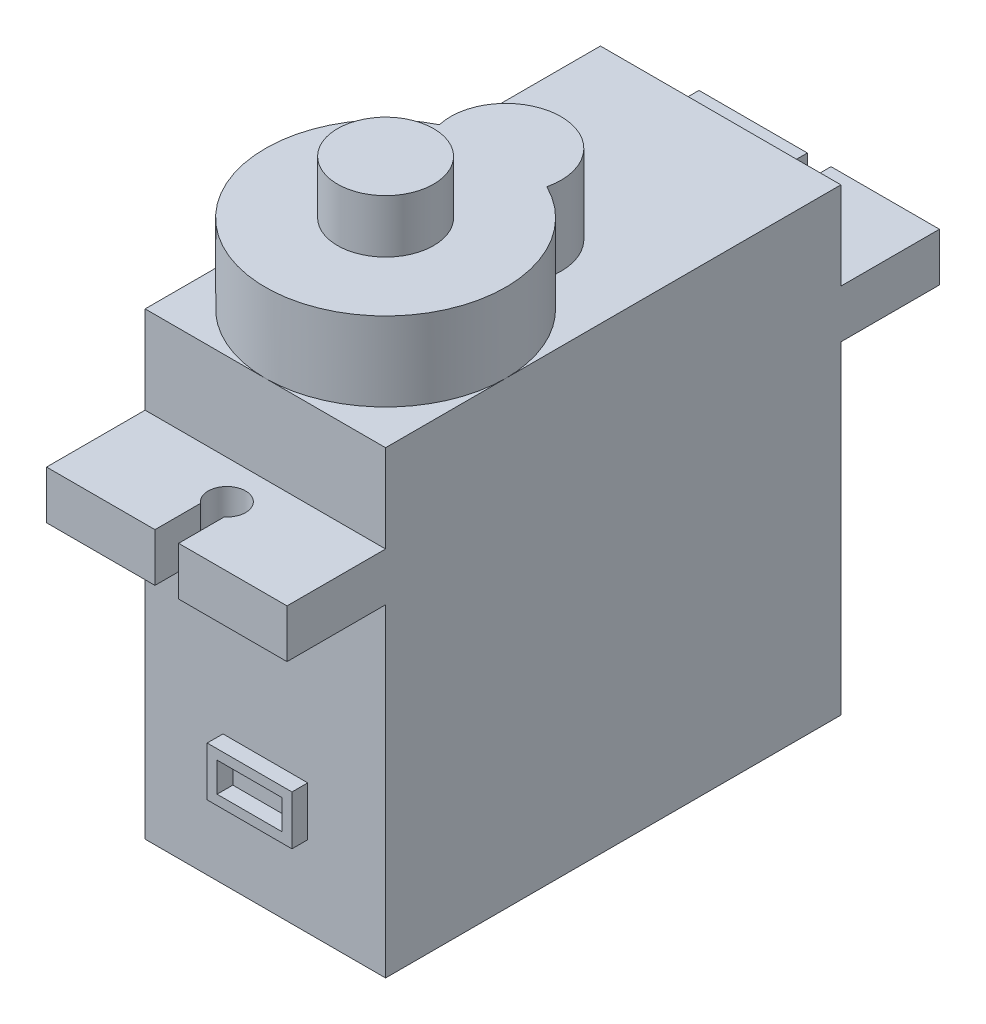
ISO-10303-21;
HEADER;
FILE_DESCRIPTION(('STEP AP214'),'2;1');
FILE_NAME('part.step','',(''),(''),'','','');
FILE_SCHEMA(('AUTOMOTIVE_DESIGN { 1 0 10303 214 1 1 1 1 }'));
ENDSEC;
DATA;
#1=APPLICATION_CONTEXT('core data for automotive mechanical design processes');
#2=APPLICATION_PROTOCOL_DEFINITION('international standard','automotive_design',2000,#1);
#3=PRODUCT_CONTEXT('',#1,'mechanical');
#4=PRODUCT('Part','Part','',(#3));
#5=PRODUCT_RELATED_PRODUCT_CATEGORY('part','',(#4));
#6=PRODUCT_DEFINITION_FORMATION('','',#4);
#7=PRODUCT_DEFINITION_CONTEXT('part definition',#1,'design');
#8=PRODUCT_DEFINITION('design','',#6,#7);
#9=PRODUCT_DEFINITION_SHAPE('','',#8);
#10=(LENGTH_UNIT() NAMED_UNIT(*) SI_UNIT(.MILLI.,.METRE.));
#11=(NAMED_UNIT(*) PLANE_ANGLE_UNIT() SI_UNIT($,.RADIAN.));
#12=(NAMED_UNIT(*) SI_UNIT($,.STERADIAN.) SOLID_ANGLE_UNIT());
#13=UNCERTAINTY_MEASURE_WITH_UNIT(LENGTH_MEASURE(1.E-05),#10,'distance_accuracy_value','');
#14=(GEOMETRIC_REPRESENTATION_CONTEXT(3) GLOBAL_UNCERTAINTY_ASSIGNED_CONTEXT((#13)) GLOBAL_UNIT_ASSIGNED_CONTEXT((#10,
#11,#12)) REPRESENTATION_CONTEXT('',''));
#15=CARTESIAN_POINT('',(0.,0.,0.));
#16=DIRECTION('',(0.,0.,1.));
#17=DIRECTION('',(1.,0.,0.));
#18=AXIS2_PLACEMENT_3D('',#15,#16,#17);
#19=CARTESIAN_POINT('',(12.2,18.85,-28.1));
#20=DIRECTION('',(0.,0.,1.));
#21=DIRECTION('',(1.,0.,0.));
#22=AXIS2_PLACEMENT_3D('',#19,#20,#21);
#23=PLANE('',#22);
#24=DIRECTION('',(-1.,0.,0.));
#25=VECTOR('',#24,1.);
#26=CARTESIAN_POINT('',(12.2,18.85,-28.1));
#27=LINE('',#26,#25);
#28=CARTESIAN_POINT('',(5.5,18.85,-28.1));
#29=VERTEX_POINT('',#28);
#30=CARTESIAN_POINT('',(0.,18.85,-28.1));
#31=VERTEX_POINT('',#30);
#32=EDGE_CURVE('E270',#29,#31,#27,.T.);
#33=ORIENTED_EDGE('',*,*,#32,.F.);
#34=DIRECTION('',(0.,1.,0.));
#35=VECTOR('',#34,1.);
#36=CARTESIAN_POINT('',(5.5,16.35,-28.1));
#37=LINE('',#36,#35);
#38=CARTESIAN_POINT('',(5.5,16.4,-28.1));
#39=VERTEX_POINT('',#38);
#40=EDGE_CURVE('E264',#39,#29,#37,.T.);
#41=ORIENTED_EDGE('',*,*,#40,.F.);
#42=DIRECTION('',(-1.,0.,0.));
#43=VECTOR('',#42,1.);
#44=CARTESIAN_POINT('',(12.2,16.4,-28.1));
#45=LINE('',#44,#43);
#46=CARTESIAN_POINT('',(0.,16.4,-28.1));
#47=VERTEX_POINT('',#46);
#48=EDGE_CURVE('E269',#39,#47,#45,.T.);
#49=ORIENTED_EDGE('',*,*,#48,.T.);
#50=DIRECTION('',(0.,1.,0.));
#51=VECTOR('',#50,1.);
#52=CARTESIAN_POINT('',(0.,18.85,-28.1));
#53=LINE('',#52,#51);
#54=EDGE_CURVE('E468',#47,#31,#53,.T.);
#55=ORIENTED_EDGE('',*,*,#54,.T.);
#56=EDGE_LOOP('',(#33,#41,#49,#55));
#57=FACE_BOUND('',#56,.T.);
#58=ADVANCED_FACE('F39',(#57),#23,.F.);
#59=CARTESIAN_POINT('',(12.2,18.85,5.));
#60=DIRECTION('',(0.,0.,-1.));
#61=DIRECTION('',(0.,1.,0.));
#62=AXIS2_PLACEMENT_3D('',#59,#60,#61);
#63=PLANE('',#62);
#64=DIRECTION('',(-1.,0.,0.));
#65=VECTOR('',#64,1.);
#66=CARTESIAN_POINT('',(12.2,18.85,5.));
#67=LINE('',#66,#65);
#68=CARTESIAN_POINT('',(12.2,18.85,5.));
#69=VERTEX_POINT('',#68);
#70=CARTESIAN_POINT('',(6.7,18.85,5.));
#71=VERTEX_POINT('',#70);
#72=EDGE_CURVE('E294',#69,#71,#67,.T.);
#73=ORIENTED_EDGE('',*,*,#72,.T.);
#74=DIRECTION('',(0.,1.,0.));
#75=VECTOR('',#74,1.);
#76=CARTESIAN_POINT('',(6.7,16.35,5.));
#77=LINE('',#76,#75);
#78=CARTESIAN_POINT('',(6.7,16.4,5.));
#79=VERTEX_POINT('',#78);
#80=EDGE_CURVE('E326',#79,#71,#77,.T.);
#81=ORIENTED_EDGE('',*,*,#80,.F.);
#82=DIRECTION('',(-1.,0.,0.));
#83=VECTOR('',#82,1.);
#84=CARTESIAN_POINT('',(12.2,16.4,4.99999999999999));
#85=LINE('',#84,#83);
#86=CARTESIAN_POINT('',(12.2,16.4,4.99999999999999));
#87=VERTEX_POINT('',#86);
#88=EDGE_CURVE('E290',#87,#79,#85,.T.);
#89=ORIENTED_EDGE('',*,*,#88,.F.);
#90=DIRECTION('',(0.,-1.,0.));
#91=VECTOR('',#90,1.);
#92=CARTESIAN_POINT('',(12.2,18.85,5.));
#93=LINE('',#92,#91);
#94=EDGE_CURVE('E428',#69,#87,#93,.T.);
#95=ORIENTED_EDGE('',*,*,#94,.F.);
#96=EDGE_LOOP('',(#73,#81,#89,#95));
#97=FACE_BOUND('',#96,.T.);
#98=ADVANCED_FACE('F561',(#97),#63,.F.);
#99=CARTESIAN_POINT('',(12.2,16.4,0.));
#100=DIRECTION('',(0.,0.,-1.));
#101=DIRECTION('',(0.,1.,0.));
#102=AXIS2_PLACEMENT_3D('',#99,#100,#101);
#103=PLANE('',#102);
#104=DIRECTION('',(0.,-1.,0.));
#105=VECTOR('',#104,1.);
#106=CARTESIAN_POINT('',(0.,16.4,0.));
#107=LINE('',#106,#105);
#108=CARTESIAN_POINT('',(0.,16.4,0.));
#109=VERTEX_POINT('',#108);
#110=CARTESIAN_POINT('',(0.,0.,0.));
#111=VERTEX_POINT('',#110);
#112=EDGE_CURVE('E459',#109,#111,#107,.T.);
#113=ORIENTED_EDGE('',*,*,#112,.T.);
#114=DIRECTION('',(-1.,0.,0.));
#115=VECTOR('',#114,1.);
#116=CARTESIAN_POINT('',(12.2,0.,0.));
#117=LINE('',#116,#115);
#118=CARTESIAN_POINT('',(12.2,0.,0.));
#119=VERTEX_POINT('',#118);
#120=EDGE_CURVE('E283',#119,#111,#117,.T.);
#121=ORIENTED_EDGE('',*,*,#120,.F.);
#122=DIRECTION('',(0.,-1.,0.));
#123=VECTOR('',#122,1.);
#124=CARTESIAN_POINT('',(12.2,16.4,0.));
#125=LINE('',#124,#123);
#126=CARTESIAN_POINT('',(12.2,16.4,0.));
#127=VERTEX_POINT('',#126);
#128=EDGE_CURVE('E432',#127,#119,#125,.T.);
#129=ORIENTED_EDGE('',*,*,#128,.F.);
#130=DIRECTION('',(-1.,0.,0.));
#131=VECTOR('',#130,1.);
#132=CARTESIAN_POINT('',(12.2,16.4,0.));
#133=LINE('',#132,#131);
#134=EDGE_CURVE('E286',#127,#109,#133,.T.);
#135=ORIENTED_EDGE('',*,*,#134,.T.);
#136=EDGE_LOOP('',(#113,#121,#129,#135));
#137=FACE_BOUND('',#136,.T.);
#138=DIRECTION('',(0.,-1.,0.));
#139=VECTOR('',#138,1.);
#140=CARTESIAN_POINT('',(3.95,4.1,0.));
#141=LINE('',#140,#139);
#142=CARTESIAN_POINT('',(3.95,6.6,0.));
#143=VERTEX_POINT('',#142);
#144=CARTESIAN_POINT('',(3.95,4.1,0.));
#145=VERTEX_POINT('',#144);
#146=EDGE_CURVE('E363',#143,#145,#141,.T.);
#147=ORIENTED_EDGE('',*,*,#146,.F.);
#148=DIRECTION('',(-1.,0.,0.));
#149=VECTOR('',#148,1.);
#150=CARTESIAN_POINT('',(3.95,6.6,0.));
#151=LINE('',#150,#149);
#152=CARTESIAN_POINT('',(8.25,6.6,0.));
#153=VERTEX_POINT('',#152);
#154=EDGE_CURVE('E368',#153,#143,#151,.T.);
#155=ORIENTED_EDGE('',*,*,#154,.F.);
#156=DIRECTION('',(0.,1.,0.));
#157=VECTOR('',#156,1.);
#158=CARTESIAN_POINT('',(8.25,4.1,0.));
#159=LINE('',#158,#157);
#160=CARTESIAN_POINT('',(8.25,4.1,0.));
#161=VERTEX_POINT('',#160);
#162=EDGE_CURVE('E380',#161,#153,#159,.T.);
#163=ORIENTED_EDGE('',*,*,#162,.F.);
#164=DIRECTION('',(1.,0.,0.));
#165=VECTOR('',#164,1.);
#166=CARTESIAN_POINT('',(3.95,4.1,0.));
#167=LINE('',#166,#165);
#168=EDGE_CURVE('E377',#145,#161,#167,.T.);
#169=ORIENTED_EDGE('',*,*,#168,.F.);
#170=EDGE_LOOP('',(#147,#155,#163,#169));
#171=FACE_BOUND('',#170,.T.);
#172=ADVANCED_FACE('F553',(#137,#171),#103,.F.);
#173=CARTESIAN_POINT('',(6.1,27.3,-9.14999999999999));
#174=DIRECTION('',(0.,1.,0.));
#175=DIRECTION('',(0.,0.,1.));
#176=AXIS2_PLACEMENT_3D('',#173,#174,#175);
#177=PLANE('',#176);
#178=CARTESIAN_POINT('',(6.1,27.3,-12.2));
#179=DIRECTION('',(0.,1.,0.));
#180=DIRECTION('',(0.,0.,1.));
#181=AXIS2_PLACEMENT_3D('',#178,#179,#180);
#182=CIRCLE('',#181,2.8);
#183=CARTESIAN_POINT('',(8.82525883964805,27.3,-11.5573770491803));
#184=VERTEX_POINT('',#183);
#185=CARTESIAN_POINT('',(3.37474116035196,27.3,-11.5573770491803));
#186=VERTEX_POINT('',#185);
#187=EDGE_CURVE('E403',#184,#186,#182,.T.);
#188=ORIENTED_EDGE('',*,*,#187,.T.);
#189=CARTESIAN_POINT('',(6.1,27.3,-6.09999999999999));
#190=DIRECTION('',(0.,1.,0.));
#191=DIRECTION('',(0.,0.,1.));
#192=AXIS2_PLACEMENT_3D('',#189,#190,#191);
#193=CIRCLE('',#192,6.09999999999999);
#194=EDGE_CURVE('E406',#186,#184,#193,.T.);
#195=ORIENTED_EDGE('',*,*,#194,.T.);
#196=EDGE_LOOP('',(#188,#195));
#197=FACE_BOUND('',#196,.T.);
#198=CARTESIAN_POINT('',(6.1,27.3,-6.09999999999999));
#199=DIRECTION('',(0.,1.,0.));
#200=DIRECTION('',(0.,0.,1.));
#201=AXIS2_PLACEMENT_3D('',#198,#199,#200);
#202=CIRCLE('',#201,2.44);
#203=CARTESIAN_POINT('',(6.1,27.3,-8.53999999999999));
#204=VERTEX_POINT('',#203);
#205=EDGE_CURVE('E396',#204,#204,#202,.T.);
#206=ORIENTED_EDGE('',*,*,#205,.F.);
#207=EDGE_LOOP('',(#206));
#208=FACE_BOUND('',#207,.T.);
#209=ADVANCED_FACE('F568',(#197,#208),#177,.T.);
#210=CARTESIAN_POINT('',(12.2,23.3,0.));
#211=DIRECTION('',(0.,-1.,0.));
#212=DIRECTION('',(0.,0.,-1.));
#213=AXIS2_PLACEMENT_3D('',#210,#211,#212);
#214=PLANE('',#213);
#215=CARTESIAN_POINT('',(6.1,23.3,-12.2));
#216=DIRECTION('',(0.,1.,0.));
#217=DIRECTION('',(0.,0.,1.));
#218=AXIS2_PLACEMENT_3D('',#215,#216,#217);
#219=CIRCLE('',#218,2.8);
#220=CARTESIAN_POINT('',(8.82525883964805,23.3,-11.5573770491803));
#221=VERTEX_POINT('',#220);
#222=CARTESIAN_POINT('',(3.37474116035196,23.3,-11.5573770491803));
#223=VERTEX_POINT('',#222);
#224=EDGE_CURVE('E400',#221,#223,#219,.T.);
#225=ORIENTED_EDGE('',*,*,#224,.F.);
#226=CARTESIAN_POINT('',(6.1,23.3,-6.09999999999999));
#227=DIRECTION('',(0.,1.,0.));
#228=DIRECTION('',(0.,0.,1.));
#229=AXIS2_PLACEMENT_3D('',#226,#227,#228);
#230=CIRCLE('',#229,6.09999999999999);
#231=CARTESIAN_POINT('',(12.2,23.3,-6.09999999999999));
#232=VERTEX_POINT('',#231);
#233=EDGE_CURVE('E304',#232,#221,#230,.T.);
#234=ORIENTED_EDGE('',*,*,#233,.F.);
#235=DIRECTION('',(0.,0.,1.));
#236=VECTOR('',#235,1.);
#237=CARTESIAN_POINT('',(12.2,23.3,0.));
#238=LINE('',#237,#236);
#239=CARTESIAN_POINT('',(12.2,23.3,-23.1));
#240=VERTEX_POINT('',#239);
#241=EDGE_CURVE('E420',#240,#232,#238,.T.);
#242=ORIENTED_EDGE('',*,*,#241,.F.);
#243=DIRECTION('',(-1.,0.,0.));
#244=VECTOR('',#243,1.);
#245=CARTESIAN_POINT('',(12.2,23.3,-23.1));
#246=LINE('',#245,#244);
#247=CARTESIAN_POINT('',(0.,23.3,-23.1));
#248=VERTEX_POINT('',#247);
#249=EDGE_CURVE('E445',#240,#248,#246,.T.);
#250=ORIENTED_EDGE('',*,*,#249,.T.);
#251=DIRECTION('',(0.,0.,1.));
#252=VECTOR('',#251,1.);
#253=CARTESIAN_POINT('',(0.,23.3,0.));
#254=LINE('',#253,#252);
#255=CARTESIAN_POINT('',(0.,23.3,-6.09999999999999));
#256=VERTEX_POINT('',#255);
#257=EDGE_CURVE('E446',#248,#256,#254,.T.);
#258=ORIENTED_EDGE('',*,*,#257,.T.);
#259=EDGE_CURVE('E407',#223,#256,#230,.T.);
#260=ORIENTED_EDGE('',*,*,#259,.F.);
#261=EDGE_LOOP('',(#225,#234,#242,#250,#258,#260));
#262=FACE_BOUND('',#261,.T.);
#263=ADVANCED_FACE('F41',(#262),#214,.F.);
#264=CARTESIAN_POINT('',(6.1,23.3,0.));
#265=VERTEX_POINT('',#264);
#266=EDGE_CURVE('E306',#256,#265,#230,.T.);
#267=ORIENTED_EDGE('',*,*,#266,.F.);
#268=CARTESIAN_POINT('',(0.,23.3,0.));
#269=VERTEX_POINT('',#268);
#270=EDGE_CURVE('E419',#256,#269,#254,.T.);
#271=ORIENTED_EDGE('',*,*,#270,.T.);
#272=DIRECTION('',(-1.,0.,0.));
#273=VECTOR('',#272,1.);
#274=CARTESIAN_POINT('',(12.2,23.3,0.));
#275=LINE('',#274,#273);
#276=EDGE_CURVE('E300',#265,#269,#275,.T.);
#277=ORIENTED_EDGE('',*,*,#276,.F.);
#278=EDGE_LOOP('',(#267,#271,#277));
#279=FACE_BOUND('',#278,.T.);
#280=ADVANCED_FACE('F508',(#279),#214,.F.);
#281=EDGE_CURVE('E502',#265,#232,#230,.T.);
#282=ORIENTED_EDGE('',*,*,#281,.F.);
#283=CARTESIAN_POINT('',(12.2,23.3,0.));
#284=VERTEX_POINT('',#283);
#285=EDGE_CURVE('E301',#284,#265,#275,.T.);
#286=ORIENTED_EDGE('',*,*,#285,.F.);
#287=EDGE_CURVE('E424',#232,#284,#238,.T.);
#288=ORIENTED_EDGE('',*,*,#287,.F.);
#289=EDGE_LOOP('',(#282,#286,#288));
#290=FACE_BOUND('',#289,.T.);
#291=ADVANCED_FACE('F506',(#290),#214,.F.);
#292=CARTESIAN_POINT('',(12.2,23.3,0.));
#293=DIRECTION('',(0.,0.,-1.));
#294=DIRECTION('',(0.,1.,0.));
#295=AXIS2_PLACEMENT_3D('',#292,#293,#294);
#296=PLANE('',#295);
#297=DIRECTION('',(0.,-1.,0.));
#298=VECTOR('',#297,1.);
#299=CARTESIAN_POINT('',(0.,23.3,0.));
#300=LINE('',#299,#298);
#301=CARTESIAN_POINT('',(0.,18.85,0.));
#302=VERTEX_POINT('',#301);
#303=EDGE_CURVE('E449',#269,#302,#300,.T.);
#304=ORIENTED_EDGE('',*,*,#303,.T.);
#305=DIRECTION('',(-1.,0.,0.));
#306=VECTOR('',#305,1.);
#307=CARTESIAN_POINT('',(12.2,18.85,0.));
#308=LINE('',#307,#306);
#309=CARTESIAN_POINT('',(12.2,18.85,0.));
#310=VERTEX_POINT('',#309);
#311=EDGE_CURVE('E297',#310,#302,#308,.T.);
#312=ORIENTED_EDGE('',*,*,#311,.F.);
#313=DIRECTION('',(0.,-1.,0.));
#314=VECTOR('',#313,1.);
#315=CARTESIAN_POINT('',(12.2,23.3,0.));
#316=LINE('',#315,#314);
#317=EDGE_CURVE('E423',#284,#310,#316,.T.);
#318=ORIENTED_EDGE('',*,*,#317,.F.);
#319=ORIENTED_EDGE('',*,*,#285,.T.);
#320=ORIENTED_EDGE('',*,*,#276,.T.);
#321=EDGE_LOOP('',(#304,#312,#318,#319,#320));
#322=FACE_BOUND('',#321,.T.);
#323=ADVANCED_FACE('F511',(#322),#296,.F.);
#324=CARTESIAN_POINT('',(12.2,18.85,0.));
#325=DIRECTION('',(0.,-1.,0.));
#326=DIRECTION('',(0.,0.,-1.));
#327=AXIS2_PLACEMENT_3D('',#324,#325,#326);
#328=PLANE('',#327);
#329=CARTESIAN_POINT('',(6.1,18.85,1.95));
#330=DIRECTION('',(0.,1.,0.));
#331=DIRECTION('',(0.,0.,1.));
#332=AXIS2_PLACEMENT_3D('',#329,#330,#331);
#333=CIRCLE('',#332,0.95);
#334=CARTESIAN_POINT('',(6.7,18.85,2.68654599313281));
#335=VERTEX_POINT('',#334);
#336=CARTESIAN_POINT('',(5.5,18.85,2.68654599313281));
#337=VERTEX_POINT('',#336);
#338=EDGE_CURVE('E535',#335,#337,#333,.T.);
#339=ORIENTED_EDGE('',*,*,#338,.F.);
#340=DIRECTION('',(0.,0.,-1.));
#341=VECTOR('',#340,1.);
#342=CARTESIAN_POINT('',(6.7,18.85,5.));
#343=LINE('',#342,#341);
#344=EDGE_CURVE('E323',#71,#335,#343,.T.);
#345=ORIENTED_EDGE('',*,*,#344,.F.);
#346=ORIENTED_EDGE('',*,*,#72,.F.);
#347=DIRECTION('',(0.,0.,1.));
#348=VECTOR('',#347,1.);
#349=CARTESIAN_POINT('',(12.2,18.85,0.));
#350=LINE('',#349,#348);
#351=EDGE_CURVE('E426',#310,#69,#350,.T.);
#352=ORIENTED_EDGE('',*,*,#351,.F.);
#353=ORIENTED_EDGE('',*,*,#311,.T.);
#354=DIRECTION('',(0.,0.,1.));
#355=VECTOR('',#354,1.);
#356=CARTESIAN_POINT('',(0.,18.85,0.));
#357=LINE('',#356,#355);
#358=CARTESIAN_POINT('',(0.,18.85,5.));
#359=VERTEX_POINT('',#358);
#360=EDGE_CURVE('E451',#302,#359,#357,.T.);
#361=ORIENTED_EDGE('',*,*,#360,.T.);
#362=CARTESIAN_POINT('',(5.5,18.85,5.));
#363=VERTEX_POINT('',#362);
#364=EDGE_CURVE('E293',#363,#359,#67,.T.);
#365=ORIENTED_EDGE('',*,*,#364,.F.);
#366=DIRECTION('',(0.,0.,1.));
#367=VECTOR('',#366,1.);
#368=CARTESIAN_POINT('',(5.5,18.85,2.68654599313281));
#369=LINE('',#368,#367);
#370=EDGE_CURVE('E536',#337,#363,#369,.T.);
#371=ORIENTED_EDGE('',*,*,#370,.F.);
#372=EDGE_LOOP('',(#339,#345,#346,#352,#353,#361,#365,#371));
#373=FACE_BOUND('',#372,.T.);
#374=ADVANCED_FACE('F543',(#373),#328,.F.);
#375=CARTESIAN_POINT('',(5.5,16.4,4.99999999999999));
#376=VERTEX_POINT('',#375);
#377=CARTESIAN_POINT('',(0.,16.4,4.99999999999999));
#378=VERTEX_POINT('',#377);
#379=EDGE_CURVE('E289',#376,#378,#85,.T.);
#380=ORIENTED_EDGE('',*,*,#379,.F.);
#381=DIRECTION('',(0.,1.,0.));
#382=VECTOR('',#381,1.);
#383=CARTESIAN_POINT('',(5.5,16.35,5.));
#384=LINE('',#383,#382);
#385=EDGE_CURVE('E62',#376,#363,#384,.T.);
#386=ORIENTED_EDGE('',*,*,#385,.T.);
#387=ORIENTED_EDGE('',*,*,#364,.T.);
#388=DIRECTION('',(0.,-1.,0.));
#389=VECTOR('',#388,1.);
#390=CARTESIAN_POINT('',(0.,18.85,5.));
#391=LINE('',#390,#389);
#392=EDGE_CURVE('E454',#359,#378,#391,.T.);
#393=ORIENTED_EDGE('',*,*,#392,.T.);
#394=EDGE_LOOP('',(#380,#386,#387,#393));
#395=FACE_BOUND('',#394,.T.);
#396=ADVANCED_FACE('F542',(#395),#63,.F.);
#397=CARTESIAN_POINT('',(12.2,16.4,4.99999999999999));
#398=DIRECTION('',(0.,1.,0.));
#399=DIRECTION('',(0.,0.,1.));
#400=AXIS2_PLACEMENT_3D('',#397,#398,#399);
#401=PLANE('',#400);
#402=ORIENTED_EDGE('',*,*,#88,.T.);
#403=DIRECTION('',(0.,0.,-1.));
#404=VECTOR('',#403,1.);
#405=CARTESIAN_POINT('',(6.7,16.4,4.99999999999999));
#406=LINE('',#405,#404);
#407=CARTESIAN_POINT('',(6.7,16.4,2.68654599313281));
#408=VERTEX_POINT('',#407);
#409=EDGE_CURVE('E11',#79,#408,#406,.T.);
#410=ORIENTED_EDGE('',*,*,#409,.T.);
#411=CARTESIAN_POINT('',(6.1,16.4,1.95));
#412=DIRECTION('',(0.,1.,0.));
#413=DIRECTION('',(0.,0.,1.));
#414=AXIS2_PLACEMENT_3D('',#411,#412,#413);
#415=CIRCLE('',#414,0.95);
#416=CARTESIAN_POINT('',(5.5,16.4,2.68654599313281));
#417=VERTEX_POINT('',#416);
#418=EDGE_CURVE('E47',#408,#417,#415,.T.);
#419=ORIENTED_EDGE('',*,*,#418,.T.);
#420=DIRECTION('',(0.,0.,1.));
#421=VECTOR('',#420,1.);
#422=CARTESIAN_POINT('',(5.5,16.4,4.99999999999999));
#423=LINE('',#422,#421);
#424=EDGE_CURVE('E305',#417,#376,#423,.T.);
#425=ORIENTED_EDGE('',*,*,#424,.T.);
#426=ORIENTED_EDGE('',*,*,#379,.T.);
#427=DIRECTION('',(0.,0.,-1.));
#428=VECTOR('',#427,1.);
#429=CARTESIAN_POINT('',(0.,16.4,4.99999999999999));
#430=LINE('',#429,#428);
#431=EDGE_CURVE('E457',#378,#109,#430,.T.);
#432=ORIENTED_EDGE('',*,*,#431,.T.);
#433=ORIENTED_EDGE('',*,*,#134,.F.);
#434=DIRECTION('',(0.,0.,-1.));
#435=VECTOR('',#434,1.);
#436=CARTESIAN_POINT('',(12.2,16.4,4.99999999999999));
#437=LINE('',#436,#435);
#438=EDGE_CURVE('E430',#87,#127,#437,.T.);
#439=ORIENTED_EDGE('',*,*,#438,.F.);
#440=EDGE_LOOP('',(#402,#410,#419,#425,#426,#432,#433,#439));
#441=FACE_BOUND('',#440,.T.);
#442=ADVANCED_FACE('F309',(#441),#401,.F.);
#443=CARTESIAN_POINT('',(12.2,0.,0.));
#444=DIRECTION('',(0.,1.,0.));
#445=DIRECTION('',(0.,0.,1.));
#446=AXIS2_PLACEMENT_3D('',#443,#444,#445);
#447=PLANE('',#446);
#448=DIRECTION('',(0.,0.,-1.));
#449=VECTOR('',#448,1.);
#450=CARTESIAN_POINT('',(0.,0.,0.));
#451=LINE('',#450,#449);
#452=CARTESIAN_POINT('',(0.,0.,-23.1));
#453=VERTEX_POINT('',#452);
#454=EDGE_CURVE('E461',#111,#453,#451,.T.);
#455=ORIENTED_EDGE('',*,*,#454,.T.);
#456=DIRECTION('',(-1.,0.,0.));
#457=VECTOR('',#456,1.);
#458=CARTESIAN_POINT('',(12.2,0.,-23.1));
#459=LINE('',#458,#457);
#460=CARTESIAN_POINT('',(12.2,0.,-23.1));
#461=VERTEX_POINT('',#460);
#462=EDGE_CURVE('E280',#461,#453,#459,.T.);
#463=ORIENTED_EDGE('',*,*,#462,.F.);
#464=DIRECTION('',(0.,0.,-1.));
#465=VECTOR('',#464,1.);
#466=CARTESIAN_POINT('',(12.2,0.,0.));
#467=LINE('',#466,#465);
#468=EDGE_CURVE('E434',#119,#461,#467,.T.);
#469=ORIENTED_EDGE('',*,*,#468,.F.);
#470=ORIENTED_EDGE('',*,*,#120,.T.);
#471=EDGE_LOOP('',(#455,#463,#469,#470));
#472=FACE_BOUND('',#471,.T.);
#473=ADVANCED_FACE('F580',(#472),#447,.F.);
#474=CARTESIAN_POINT('',(12.2,16.4,-23.1));
#475=DIRECTION('',(0.,0.,1.));
#476=DIRECTION('',(1.,0.,0.));
#477=AXIS2_PLACEMENT_3D('',#474,#475,#476);
#478=PLANE('',#477);
#479=DIRECTION('',(0.,1.,0.));
#480=VECTOR('',#479,1.);
#481=CARTESIAN_POINT('',(0.,16.4,-23.1));
#482=LINE('',#481,#480);
#483=CARTESIAN_POINT('',(0.,16.4,-23.1));
#484=VERTEX_POINT('',#483);
#485=EDGE_CURVE('E463',#453,#484,#482,.T.);
#486=ORIENTED_EDGE('',*,*,#485,.T.);
#487=DIRECTION('',(-1.,0.,0.));
#488=VECTOR('',#487,1.);
#489=CARTESIAN_POINT('',(12.2,16.4,-23.1));
#490=LINE('',#489,#488);
#491=CARTESIAN_POINT('',(12.2,16.4,-23.1));
#492=VERTEX_POINT('',#491);
#493=EDGE_CURVE('E277',#492,#484,#490,.T.);
#494=ORIENTED_EDGE('',*,*,#493,.F.);
#495=DIRECTION('',(0.,1.,0.));
#496=VECTOR('',#495,1.);
#497=CARTESIAN_POINT('',(12.2,16.4,-23.1));
#498=LINE('',#497,#496);
#499=EDGE_CURVE('E436',#461,#492,#498,.T.);
#500=ORIENTED_EDGE('',*,*,#499,.F.);
#501=ORIENTED_EDGE('',*,*,#462,.T.);
#502=EDGE_LOOP('',(#486,#494,#500,#501));
#503=FACE_BOUND('',#502,.T.);
#504=ADVANCED_FACE('F618',(#503),#478,.F.);
#505=CARTESIAN_POINT('',(12.2,16.4,-28.1));
#506=DIRECTION('',(0.,1.,0.));
#507=DIRECTION('',(0.,0.,1.));
#508=AXIS2_PLACEMENT_3D('',#505,#506,#507);
#509=PLANE('',#508);
#510=ORIENTED_EDGE('',*,*,#48,.F.);
#511=DIRECTION('',(0.,0.,1.));
#512=VECTOR('',#511,1.);
#513=CARTESIAN_POINT('',(5.5,16.4,-28.1));
#514=LINE('',#513,#512);
#515=CARTESIAN_POINT('',(5.5,16.4,-25.7865459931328));
#516=VERTEX_POINT('',#515);
#517=EDGE_CURVE('E527',#39,#516,#514,.T.);
#518=ORIENTED_EDGE('',*,*,#517,.T.);
#519=CARTESIAN_POINT('',(6.1,16.4,-25.05));
#520=DIRECTION('',(0.,1.,0.));
#521=DIRECTION('',(0.,0.,1.));
#522=AXIS2_PLACEMENT_3D('',#519,#520,#521);
#523=CIRCLE('',#522,0.949999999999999);
#524=CARTESIAN_POINT('',(6.7,16.4,-25.7865459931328));
#525=VERTEX_POINT('',#524);
#526=EDGE_CURVE('E526',#516,#525,#523,.T.);
#527=ORIENTED_EDGE('',*,*,#526,.T.);
#528=DIRECTION('',(0.,0.,-1.));
#529=VECTOR('',#528,1.);
#530=CARTESIAN_POINT('',(6.69999999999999,16.4,-28.1));
#531=LINE('',#530,#529);
#532=CARTESIAN_POINT('',(6.69999999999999,16.4,-28.1));
#533=VERTEX_POINT('',#532);
#534=EDGE_CURVE('E524',#525,#533,#531,.T.);
#535=ORIENTED_EDGE('',*,*,#534,.T.);
#536=CARTESIAN_POINT('',(12.2,16.4,-28.1));
#537=VERTEX_POINT('',#536);
#538=EDGE_CURVE('E263',#537,#533,#45,.T.);
#539=ORIENTED_EDGE('',*,*,#538,.F.);
#540=DIRECTION('',(0.,0.,-1.));
#541=VECTOR('',#540,1.);
#542=CARTESIAN_POINT('',(12.2,16.4,-28.1));
#543=LINE('',#542,#541);
#544=EDGE_CURVE('E438',#492,#537,#543,.T.);
#545=ORIENTED_EDGE('',*,*,#544,.F.);
#546=ORIENTED_EDGE('',*,*,#493,.T.);
#547=DIRECTION('',(0.,0.,-1.));
#548=VECTOR('',#547,1.);
#549=CARTESIAN_POINT('',(0.,16.4,-28.1));
#550=LINE('',#549,#548);
#551=EDGE_CURVE('E465',#484,#47,#550,.T.);
#552=ORIENTED_EDGE('',*,*,#551,.T.);
#553=EDGE_LOOP('',(#510,#518,#527,#535,#539,#545,#546,#552));
#554=FACE_BOUND('',#553,.T.);
#555=ADVANCED_FACE('F522',(#554),#509,.F.);
#556=ORIENTED_EDGE('',*,*,#538,.T.);
#557=DIRECTION('',(0.,1.,0.));
#558=VECTOR('',#557,1.);
#559=CARTESIAN_POINT('',(6.69999999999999,16.35,-28.1));
#560=LINE('',#559,#558);
#561=CARTESIAN_POINT('',(6.69999999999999,18.85,-28.1));
#562=VERTEX_POINT('',#561);
#563=EDGE_CURVE('E248',#533,#562,#560,.T.);
#564=ORIENTED_EDGE('',*,*,#563,.T.);
#565=CARTESIAN_POINT('',(12.2,18.85,-28.1));
#566=VERTEX_POINT('',#565);
#567=EDGE_CURVE('E260',#566,#562,#27,.T.);
#568=ORIENTED_EDGE('',*,*,#567,.F.);
#569=DIRECTION('',(0.,1.,0.));
#570=VECTOR('',#569,1.);
#571=CARTESIAN_POINT('',(12.2,18.85,-28.1));
#572=LINE('',#571,#570);
#573=EDGE_CURVE('E440',#537,#566,#572,.T.);
#574=ORIENTED_EDGE('',*,*,#573,.F.);
#575=EDGE_LOOP('',(#556,#564,#568,#574));
#576=FACE_BOUND('',#575,.T.);
#577=ADVANCED_FACE('F258',(#576),#23,.F.);
#578=CARTESIAN_POINT('',(12.2,18.85,-23.1));
#579=DIRECTION('',(0.,-1.,0.));
#580=DIRECTION('',(0.,0.,-1.));
#581=AXIS2_PLACEMENT_3D('',#578,#579,#580);
#582=PLANE('',#581);
#583=CARTESIAN_POINT('',(6.1,18.85,-25.05));
#584=DIRECTION('',(0.,1.,0.));
#585=DIRECTION('',(0.,0.,-1.));
#586=AXIS2_PLACEMENT_3D('',#583,#584,#585);
#587=CIRCLE('',#586,0.949999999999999);
#588=CARTESIAN_POINT('',(5.5,18.85,-25.7865459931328));
#589=VERTEX_POINT('',#588);
#590=CARTESIAN_POINT('',(6.7,18.85,-25.7865459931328));
#591=VERTEX_POINT('',#590);
#592=EDGE_CURVE('E54',#589,#591,#587,.T.);
#593=ORIENTED_EDGE('',*,*,#592,.F.);
#594=DIRECTION('',(0.,0.,1.));
#595=VECTOR('',#594,1.);
#596=CARTESIAN_POINT('',(5.5,18.85,-25.7865459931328));
#597=LINE('',#596,#595);
#598=EDGE_CURVE('E253',#29,#589,#597,.T.);
#599=ORIENTED_EDGE('',*,*,#598,.F.);
#600=ORIENTED_EDGE('',*,*,#32,.T.);
#601=DIRECTION('',(0.,0.,1.));
#602=VECTOR('',#601,1.);
#603=CARTESIAN_POINT('',(0.,18.85,-23.1));
#604=LINE('',#603,#602);
#605=CARTESIAN_POINT('',(0.,18.85,-23.1));
#606=VERTEX_POINT('',#605);
#607=EDGE_CURVE('E471',#31,#606,#604,.T.);
#608=ORIENTED_EDGE('',*,*,#607,.T.);
#609=DIRECTION('',(-1.,0.,0.));
#610=VECTOR('',#609,1.);
#611=CARTESIAN_POINT('',(12.2,18.85,-23.1));
#612=LINE('',#611,#610);
#613=CARTESIAN_POINT('',(12.2,18.85,-23.1));
#614=VERTEX_POINT('',#613);
#615=EDGE_CURVE('E273',#614,#606,#612,.T.);
#616=ORIENTED_EDGE('',*,*,#615,.F.);
#617=DIRECTION('',(0.,0.,1.));
#618=VECTOR('',#617,1.);
#619=CARTESIAN_POINT('',(12.2,18.85,-23.1));
#620=LINE('',#619,#618);
#621=EDGE_CURVE('E268',#566,#614,#620,.T.);
#622=ORIENTED_EDGE('',*,*,#621,.F.);
#623=ORIENTED_EDGE('',*,*,#567,.T.);
#624=DIRECTION('',(0.,0.,-1.));
#625=VECTOR('',#624,1.);
#626=CARTESIAN_POINT('',(6.69999999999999,18.85,-28.1));
#627=LINE('',#626,#625);
#628=EDGE_CURVE('E245',#591,#562,#627,.T.);
#629=ORIENTED_EDGE('',*,*,#628,.F.);
#630=EDGE_LOOP('',(#593,#599,#600,#608,#616,#622,#623,#629));
#631=FACE_BOUND('',#630,.T.);
#632=ADVANCED_FACE('F266',(#631),#582,.F.);
#633=CARTESIAN_POINT('',(12.2,23.3,-23.1));
#634=DIRECTION('',(0.,0.,1.));
#635=DIRECTION('',(1.,0.,0.));
#636=AXIS2_PLACEMENT_3D('',#633,#634,#635);
#637=PLANE('',#636);
#638=DIRECTION('',(0.,1.,0.));
#639=VECTOR('',#638,1.);
#640=CARTESIAN_POINT('',(0.,23.3,-23.1));
#641=LINE('',#640,#639);
#642=EDGE_CURVE('E473',#606,#248,#641,.T.);
#643=ORIENTED_EDGE('',*,*,#642,.T.);
#644=ORIENTED_EDGE('',*,*,#249,.F.);
#645=DIRECTION('',(0.,1.,0.));
#646=VECTOR('',#645,1.);
#647=CARTESIAN_POINT('',(12.2,23.3,-23.1));
#648=LINE('',#647,#646);
#649=EDGE_CURVE('E443',#614,#240,#648,.T.);
#650=ORIENTED_EDGE('',*,*,#649,.F.);
#651=ORIENTED_EDGE('',*,*,#615,.T.);
#652=EDGE_LOOP('',(#643,#644,#650,#651));
#653=FACE_BOUND('',#652,.T.);
#654=ADVANCED_FACE('F483',(#653),#637,.F.);
#655=CARTESIAN_POINT('',(12.2,0.,0.));
#656=DIRECTION('',(-1.,0.,0.));
#657=DIRECTION('',(0.,0.,1.));
#658=AXIS2_PLACEMENT_3D('',#655,#656,#657);
#659=PLANE('',#658);
#660=ORIENTED_EDGE('',*,*,#241,.T.);
#661=ORIENTED_EDGE('',*,*,#287,.T.);
#662=ORIENTED_EDGE('',*,*,#317,.T.);
#663=ORIENTED_EDGE('',*,*,#351,.T.);
#664=ORIENTED_EDGE('',*,*,#94,.T.);
#665=ORIENTED_EDGE('',*,*,#438,.T.);
#666=ORIENTED_EDGE('',*,*,#128,.T.);
#667=ORIENTED_EDGE('',*,*,#468,.T.);
#668=ORIENTED_EDGE('',*,*,#499,.T.);
#669=ORIENTED_EDGE('',*,*,#544,.T.);
#670=ORIENTED_EDGE('',*,*,#573,.T.);
#671=ORIENTED_EDGE('',*,*,#621,.T.);
#672=ORIENTED_EDGE('',*,*,#649,.T.);
#673=EDGE_LOOP('',(#660,#661,#662,#663,#664,#665,#666,#667,#668,#669,#670,#671,#672));
#674=FACE_BOUND('',#673,.T.);
#675=ADVANCED_FACE('F515',(#674),#659,.F.);
#676=CARTESIAN_POINT('',(0.,0.,0.));
#677=DIRECTION('',(-1.,0.,0.));
#678=DIRECTION('',(0.,0.,1.));
#679=AXIS2_PLACEMENT_3D('',#676,#677,#678);
#680=PLANE('',#679);
#681=ORIENTED_EDGE('',*,*,#257,.F.);
#682=ORIENTED_EDGE('',*,*,#642,.F.);
#683=ORIENTED_EDGE('',*,*,#607,.F.);
#684=ORIENTED_EDGE('',*,*,#54,.F.);
#685=ORIENTED_EDGE('',*,*,#551,.F.);
#686=ORIENTED_EDGE('',*,*,#485,.F.);
#687=ORIENTED_EDGE('',*,*,#454,.F.);
#688=ORIENTED_EDGE('',*,*,#112,.F.);
#689=ORIENTED_EDGE('',*,*,#431,.F.);
#690=ORIENTED_EDGE('',*,*,#392,.F.);
#691=ORIENTED_EDGE('',*,*,#360,.F.);
#692=ORIENTED_EDGE('',*,*,#303,.F.);
#693=ORIENTED_EDGE('',*,*,#270,.F.);
#694=EDGE_LOOP('',(#681,#682,#683,#684,#685,#686,#687,#688,#689,#690,#691,#692,#693));
#695=FACE_BOUND('',#694,.T.);
#696=ADVANCED_FACE('F486',(#695),#680,.T.);
#697=CARTESIAN_POINT('',(6.1,27.3,-12.2));
#698=DIRECTION('',(0.,-1.,0.));
#699=DIRECTION('',(0.,0.,-1.));
#700=AXIS2_PLACEMENT_3D('',#697,#698,#699);
#701=CYLINDRICAL_SURFACE('',#700,2.8);
#702=ORIENTED_EDGE('',*,*,#224,.T.);
#703=DIRECTION('',(0.,-1.,0.));
#704=VECTOR('',#703,1.);
#705=CARTESIAN_POINT('',(3.37474116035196,27.3,-11.5573770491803));
#706=LINE('',#705,#704);
#707=EDGE_CURVE('E416',#186,#223,#706,.T.);
#708=ORIENTED_EDGE('',*,*,#707,.F.);
#709=ORIENTED_EDGE('',*,*,#187,.F.);
#710=DIRECTION('',(0.,-1.,0.));
#711=VECTOR('',#710,1.);
#712=CARTESIAN_POINT('',(8.82525883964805,27.3,-11.5573770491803));
#713=LINE('',#712,#711);
#714=EDGE_CURVE('E409',#184,#221,#713,.T.);
#715=ORIENTED_EDGE('',*,*,#714,.T.);
#716=EDGE_LOOP('',(#702,#708,#709,#715));
#717=FACE_BOUND('',#716,.T.);
#718=ADVANCED_FACE('F499',(#717),#701,.T.);
#719=CARTESIAN_POINT('',(6.1,27.3,-6.09999999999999));
#720=DIRECTION('',(0.,-1.,0.));
#721=DIRECTION('',(0.,0.,-1.));
#722=AXIS2_PLACEMENT_3D('',#719,#720,#721);
#723=CYLINDRICAL_SURFACE('',#722,6.09999999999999);
#724=ORIENTED_EDGE('',*,*,#259,.T.);
#725=ORIENTED_EDGE('',*,*,#266,.T.);
#726=ORIENTED_EDGE('',*,*,#281,.T.);
#727=ORIENTED_EDGE('',*,*,#233,.T.);
#728=ORIENTED_EDGE('',*,*,#714,.F.);
#729=ORIENTED_EDGE('',*,*,#194,.F.);
#730=ORIENTED_EDGE('',*,*,#707,.T.);
#731=EDGE_LOOP('',(#724,#725,#726,#727,#728,#729,#730));
#732=FACE_BOUND('',#731,.T.);
#733=ADVANCED_FACE('F493',(#732),#723,.T.);
#734=CARTESIAN_POINT('',(6.1,30.,-6.09999999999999));
#735=DIRECTION('',(0.,-1.,0.));
#736=DIRECTION('',(0.,0.,-1.));
#737=AXIS2_PLACEMENT_3D('',#734,#735,#736);
#738=CYLINDRICAL_SURFACE('',#737,2.44);
#739=CARTESIAN_POINT('',(6.1,30.,-6.09999999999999));
#740=DIRECTION('',(0.,1.,0.));
#741=DIRECTION('',(0.,0.,1.));
#742=AXIS2_PLACEMENT_3D('',#739,#740,#741);
#743=CIRCLE('',#742,2.44);
#744=CARTESIAN_POINT('',(6.1,30.,-8.53999999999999));
#745=VERTEX_POINT('',#744);
#746=EDGE_CURVE('E397',#745,#745,#743,.T.);
#747=CARTESIAN_POINT('',(6.1,30.,-8.53999999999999));
#748=CARTESIAN_POINT('',(6.1,29.971875,-8.53999999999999));
#749=CARTESIAN_POINT('',(6.1,29.94375,-8.53999999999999));
#750=CARTESIAN_POINT('',(6.1,29.8875,-8.53999999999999));
#751=CARTESIAN_POINT('',(6.1,29.859375,-8.53999999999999));
#752=CARTESIAN_POINT('',(6.1,29.803125,-8.53999999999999));
#753=CARTESIAN_POINT('',(6.1,29.775,-8.53999999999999));
#754=CARTESIAN_POINT('',(6.1,29.71875,-8.53999999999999));
#755=CARTESIAN_POINT('',(6.1,29.690625,-8.53999999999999));
#756=CARTESIAN_POINT('',(6.1,29.634375,-8.53999999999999));
#757=CARTESIAN_POINT('',(6.1,29.60625,-8.53999999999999));
#758=CARTESIAN_POINT('',(6.1,29.55,-8.53999999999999));
#759=CARTESIAN_POINT('',(6.1,29.521875,-8.53999999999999));
#760=CARTESIAN_POINT('',(6.1,29.465625,-8.53999999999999));
#761=CARTESIAN_POINT('',(6.1,29.4375,-8.53999999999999));
#762=CARTESIAN_POINT('',(6.1,29.38125,-8.53999999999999));
#763=CARTESIAN_POINT('',(6.1,29.353125,-8.53999999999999));
#764=CARTESIAN_POINT('',(6.1,29.296875,-8.53999999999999));
#765=CARTESIAN_POINT('',(6.1,29.26875,-8.53999999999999));
#766=CARTESIAN_POINT('',(6.1,29.2125,-8.53999999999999));
#767=CARTESIAN_POINT('',(6.1,29.184375,-8.53999999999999));
#768=CARTESIAN_POINT('',(6.1,29.128125,-8.53999999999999));
#769=CARTESIAN_POINT('',(6.1,29.1,-8.53999999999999));
#770=CARTESIAN_POINT('',(6.1,29.04375,-8.53999999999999));
#771=CARTESIAN_POINT('',(6.1,29.015625,-8.53999999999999));
#772=CARTESIAN_POINT('',(6.1,28.959375,-8.53999999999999));
#773=CARTESIAN_POINT('',(6.1,28.93125,-8.53999999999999));
#774=CARTESIAN_POINT('',(6.1,28.875,-8.53999999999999));
#775=CARTESIAN_POINT('',(6.1,28.846875,-8.53999999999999));
#776=CARTESIAN_POINT('',(6.1,28.790625,-8.53999999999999));
#777=CARTESIAN_POINT('',(6.1,28.7625,-8.53999999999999));
#778=CARTESIAN_POINT('',(6.1,28.70625,-8.53999999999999));
#779=CARTESIAN_POINT('',(6.1,28.678125,-8.53999999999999));
#780=CARTESIAN_POINT('',(6.1,28.621875,-8.53999999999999));
#781=CARTESIAN_POINT('',(6.1,28.59375,-8.53999999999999));
#782=CARTESIAN_POINT('',(6.1,28.5375,-8.53999999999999));
#783=CARTESIAN_POINT('',(6.1,28.509375,-8.53999999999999));
#784=CARTESIAN_POINT('',(6.1,28.453125,-8.53999999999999));
#785=CARTESIAN_POINT('',(6.1,28.425,-8.53999999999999));
#786=CARTESIAN_POINT('',(6.1,28.36875,-8.53999999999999));
#787=CARTESIAN_POINT('',(6.1,28.340625,-8.53999999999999));
#788=CARTESIAN_POINT('',(6.1,28.284375,-8.53999999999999));
#789=CARTESIAN_POINT('',(6.1,28.25625,-8.53999999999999));
#790=CARTESIAN_POINT('',(6.1,28.2,-8.53999999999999));
#791=CARTESIAN_POINT('',(6.1,28.171875,-8.53999999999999));
#792=CARTESIAN_POINT('',(6.1,28.115625,-8.53999999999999));
#793=CARTESIAN_POINT('',(6.1,28.0875,-8.53999999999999));
#794=CARTESIAN_POINT('',(6.1,28.03125,-8.53999999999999));
#795=CARTESIAN_POINT('',(6.1,28.003125,-8.53999999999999));
#796=CARTESIAN_POINT('',(6.1,27.946875,-8.53999999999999));
#797=CARTESIAN_POINT('',(6.1,27.91875,-8.53999999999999));
#798=CARTESIAN_POINT('',(6.1,27.8625,-8.53999999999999));
#799=CARTESIAN_POINT('',(6.1,27.834375,-8.53999999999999));
#800=CARTESIAN_POINT('',(6.1,27.778125,-8.53999999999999));
#801=CARTESIAN_POINT('',(6.1,27.75,-8.53999999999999));
#802=CARTESIAN_POINT('',(6.1,27.69375,-8.53999999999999));
#803=CARTESIAN_POINT('',(6.1,27.665625,-8.53999999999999));
#804=CARTESIAN_POINT('',(6.1,27.609375,-8.53999999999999));
#805=CARTESIAN_POINT('',(6.1,27.58125,-8.53999999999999));
#806=CARTESIAN_POINT('',(6.1,27.525,-8.53999999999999));
#807=CARTESIAN_POINT('',(6.1,27.496875,-8.53999999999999));
#808=CARTESIAN_POINT('',(6.1,27.440625,-8.53999999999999));
#809=CARTESIAN_POINT('',(6.1,27.4125,-8.53999999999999));
#810=CARTESIAN_POINT('',(6.1,27.35625,-8.53999999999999));
#811=CARTESIAN_POINT('',(6.1,27.328125,-8.53999999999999));
#812=CARTESIAN_POINT('',(6.1,27.3,-8.53999999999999));
#813=B_SPLINE_CURVE_WITH_KNOTS('',3,(#747,#748,#749,#750,#751,#752,#753,#754,#755,#756,#757,
#758,#759,#760,#761,#762,#763,#764,#765,#766,#767,#768,#769,#770,#771,#772,#773,#774,#775,#776,
#777,#778,#779,#780,#781,#782,#783,#784,#785,#786,#787,#788,#789,#790,#791,#792,#793,#794,#795,
#796,#797,#798,#799,#800,#801,#802,#803,#804,#805,#806,#807,#808,#809,#810,#811,#812),
.UNSPECIFIED.,.F.,.F.,(4,2,2,2,2,2,2,2,2,2,2,2,2,2,2,2,2,2,2,2,2,2,2,2,2,2,2,2,2,2,2,2,4),(0.,
0.0843749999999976,0.168749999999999,0.253125,0.337499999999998,0.421874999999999,0.50625,
0.590624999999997,0.674999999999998,0.759375,0.843749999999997,0.928124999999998,1.0125,
1.096875,1.18125,1.265625,1.35,1.434375,1.51875,1.603125,1.6875,1.771875,1.85625,1.940625,2.025,
2.109375,2.19375,2.278125,2.3625,2.446875,2.53125,2.615625,2.7),.UNSPECIFIED.);
#814=EDGE_CURVE('BSEAM601',#745,#204,#813,.T.);
#815=ORIENTED_EDGE('',*,*,#746,.F.);
#816=ORIENTED_EDGE('',*,*,#205,.T.);
#817=ORIENTED_EDGE('',*,*,#814,.T.);
#818=ORIENTED_EDGE('',*,*,#814,.F.);
#819=EDGE_LOOP('',(#815,#817,#816,#818));
#820=FACE_BOUND('',#819,.T.);
#821=ADVANCED_FACE('F601',(#820),#738,.T.);
#822=CARTESIAN_POINT('',(6.1,30.,-6.09999999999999));
#823=DIRECTION('',(0.,1.,0.));
#824=DIRECTION('',(0.,0.,1.));
#825=AXIS2_PLACEMENT_3D('',#822,#823,#824);
#826=PLANE('',#825);
#827=ORIENTED_EDGE('',*,*,#746,.T.);
#828=EDGE_LOOP('',(#827));
#829=FACE_BOUND('',#828,.T.);
#830=ADVANCED_FACE('F665',(#829),#826,.T.);
#831=CARTESIAN_POINT('',(0.,0.,0.8));
#832=DIRECTION('',(0.,0.,-1.));
#833=DIRECTION('',(-1.,0.,0.));
#834=AXIS2_PLACEMENT_3D('',#831,#832,#833);
#835=PLANE('',#834);
#836=DIRECTION('',(0.,-1.,0.));
#837=VECTOR('',#836,1.);
#838=CARTESIAN_POINT('',(3.95,4.1,0.8));
#839=LINE('',#838,#837);
#840=CARTESIAN_POINT('',(3.95,6.6,0.8));
#841=VERTEX_POINT('',#840);
#842=CARTESIAN_POINT('',(3.95,4.1,0.8));
#843=VERTEX_POINT('',#842);
#844=EDGE_CURVE('E364',#841,#843,#839,.T.);
#845=ORIENTED_EDGE('',*,*,#844,.T.);
#846=DIRECTION('',(1.,0.,0.));
#847=VECTOR('',#846,1.);
#848=CARTESIAN_POINT('',(3.95,4.1,0.8));
#849=LINE('',#848,#847);
#850=CARTESIAN_POINT('',(8.25,4.1,0.8));
#851=VERTEX_POINT('',#850);
#852=EDGE_CURVE('E367',#843,#851,#849,.T.);
#853=ORIENTED_EDGE('',*,*,#852,.T.);
#854=DIRECTION('',(0.,1.,0.));
#855=VECTOR('',#854,1.);
#856=CARTESIAN_POINT('',(8.25,4.1,0.8));
#857=LINE('',#856,#855);
#858=CARTESIAN_POINT('',(8.25,6.6,0.8));
#859=VERTEX_POINT('',#858);
#860=EDGE_CURVE('E370',#851,#859,#857,.T.);
#861=ORIENTED_EDGE('',*,*,#860,.T.);
#862=DIRECTION('',(-1.,0.,0.));
#863=VECTOR('',#862,1.);
#864=CARTESIAN_POINT('',(3.95,6.6,0.8));
#865=LINE('',#864,#863);
#866=EDGE_CURVE('E372',#859,#841,#865,.T.);
#867=ORIENTED_EDGE('',*,*,#866,.T.);
#868=EDGE_LOOP('',(#845,#853,#861,#867));
#869=FACE_BOUND('',#868,.T.);
#870=DIRECTION('',(0.,-1.,0.));
#871=VECTOR('',#870,1.);
#872=CARTESIAN_POINT('',(4.45,4.6,0.8));
#873=LINE('',#872,#871);
#874=CARTESIAN_POINT('',(4.45,6.1,0.8));
#875=VERTEX_POINT('',#874);
#876=CARTESIAN_POINT('',(4.45,4.6,0.8));
#877=VERTEX_POINT('',#876);
#878=EDGE_CURVE('E337',#875,#877,#873,.T.);
#879=ORIENTED_EDGE('',*,*,#878,.F.);
#880=DIRECTION('',(-1.,0.,0.));
#881=VECTOR('',#880,1.);
#882=CARTESIAN_POINT('',(4.45,6.1,0.8));
#883=LINE('',#882,#881);
#884=CARTESIAN_POINT('',(7.75,6.1,0.8));
#885=VERTEX_POINT('',#884);
#886=EDGE_CURVE('E345',#885,#875,#883,.T.);
#887=ORIENTED_EDGE('',*,*,#886,.F.);
#888=DIRECTION('',(0.,1.,0.));
#889=VECTOR('',#888,1.);
#890=CARTESIAN_POINT('',(7.75,4.6,0.8));
#891=LINE('',#890,#889);
#892=CARTESIAN_POINT('',(7.75,4.6,0.8));
#893=VERTEX_POINT('',#892);
#894=EDGE_CURVE('E342',#893,#885,#891,.T.);
#895=ORIENTED_EDGE('',*,*,#894,.F.);
#896=DIRECTION('',(1.,0.,0.));
#897=VECTOR('',#896,1.);
#898=CARTESIAN_POINT('',(4.45,4.6,0.8));
#899=LINE('',#898,#897);
#900=EDGE_CURVE('E339',#877,#893,#899,.T.);
#901=ORIENTED_EDGE('',*,*,#900,.F.);
#902=EDGE_LOOP('',(#879,#887,#895,#901));
#903=FACE_BOUND('',#902,.T.);
#904=ADVANCED_FACE('F650',(#869,#903),#835,.F.);
#905=CARTESIAN_POINT('',(3.95,4.1,0.8));
#906=DIRECTION('',(1.,0.,0.));
#907=DIRECTION('',(0.,0.,-1.));
#908=AXIS2_PLACEMENT_3D('',#905,#906,#907);
#909=PLANE('',#908);
#910=ORIENTED_EDGE('',*,*,#146,.T.);
#911=DIRECTION('',(0.,0.,-1.));
#912=VECTOR('',#911,1.);
#913=CARTESIAN_POINT('',(3.95,4.1,0.8));
#914=LINE('',#913,#912);
#915=EDGE_CURVE('E393',#843,#145,#914,.T.);
#916=ORIENTED_EDGE('',*,*,#915,.F.);
#917=ORIENTED_EDGE('',*,*,#844,.F.);
#918=DIRECTION('',(0.,0.,-1.));
#919=VECTOR('',#918,1.);
#920=CARTESIAN_POINT('',(3.95,6.6,0.8));
#921=LINE('',#920,#919);
#922=EDGE_CURVE('E374',#841,#143,#921,.T.);
#923=ORIENTED_EDGE('',*,*,#922,.T.);
#924=EDGE_LOOP('',(#910,#916,#917,#923));
#925=FACE_BOUND('',#924,.T.);
#926=ADVANCED_FACE('F664',(#925),#909,.F.);
#927=CARTESIAN_POINT('',(3.95,4.1,0.8));
#928=DIRECTION('',(0.,1.,0.));
#929=DIRECTION('',(0.,0.,1.));
#930=AXIS2_PLACEMENT_3D('',#927,#928,#929);
#931=PLANE('',#930);
#932=ORIENTED_EDGE('',*,*,#168,.T.);
#933=DIRECTION('',(0.,0.,-1.));
#934=VECTOR('',#933,1.);
#935=CARTESIAN_POINT('',(8.25,4.1,0.8));
#936=LINE('',#935,#934);
#937=EDGE_CURVE('E390',#851,#161,#936,.T.);
#938=ORIENTED_EDGE('',*,*,#937,.F.);
#939=ORIENTED_EDGE('',*,*,#852,.F.);
#940=ORIENTED_EDGE('',*,*,#915,.T.);
#941=EDGE_LOOP('',(#932,#938,#939,#940));
#942=FACE_BOUND('',#941,.T.);
#943=ADVANCED_FACE('F673',(#942),#931,.F.);
#944=CARTESIAN_POINT('',(8.25,4.1,0.8));
#945=DIRECTION('',(-1.,0.,0.));
#946=DIRECTION('',(0.,0.,1.));
#947=AXIS2_PLACEMENT_3D('',#944,#945,#946);
#948=PLANE('',#947);
#949=ORIENTED_EDGE('',*,*,#162,.T.);
#950=DIRECTION('',(0.,0.,-1.));
#951=VECTOR('',#950,1.);
#952=CARTESIAN_POINT('',(8.25,6.6,0.8));
#953=LINE('',#952,#951);
#954=EDGE_CURVE('E387',#859,#153,#953,.T.);
#955=ORIENTED_EDGE('',*,*,#954,.F.);
#956=ORIENTED_EDGE('',*,*,#860,.F.);
#957=ORIENTED_EDGE('',*,*,#937,.T.);
#958=EDGE_LOOP('',(#949,#955,#956,#957));
#959=FACE_BOUND('',#958,.T.);
#960=ADVANCED_FACE('F669',(#959),#948,.F.);
#961=CARTESIAN_POINT('',(3.95,6.6,0.8));
#962=DIRECTION('',(0.,-1.,0.));
#963=DIRECTION('',(1.,0.,0.));
#964=AXIS2_PLACEMENT_3D('',#961,#962,#963);
#965=PLANE('',#964);
#966=ORIENTED_EDGE('',*,*,#154,.T.);
#967=ORIENTED_EDGE('',*,*,#922,.F.);
#968=ORIENTED_EDGE('',*,*,#866,.F.);
#969=ORIENTED_EDGE('',*,*,#954,.T.);
#970=EDGE_LOOP('',(#966,#967,#968,#969));
#971=FACE_BOUND('',#970,.T.);
#972=ADVANCED_FACE('F661',(#971),#965,.F.);
#973=CARTESIAN_POINT('',(4.45,4.6,0.8));
#974=DIRECTION('',(1.,0.,0.));
#975=DIRECTION('',(0.,0.,-1.));
#976=AXIS2_PLACEMENT_3D('',#973,#974,#975);
#977=PLANE('',#976);
#978=DIRECTION('',(0.,-1.,0.));
#979=VECTOR('',#978,1.);
#980=CARTESIAN_POINT('',(4.45,4.6,0.));
#981=LINE('',#980,#979);
#982=CARTESIAN_POINT('',(4.45,6.1,0.));
#983=VERTEX_POINT('',#982);
#984=CARTESIAN_POINT('',(4.45,4.6,0.));
#985=VERTEX_POINT('',#984);
#986=EDGE_CURVE('E325',#983,#985,#981,.T.);
#987=ORIENTED_EDGE('',*,*,#986,.F.);
#988=DIRECTION('',(0.,0.,-1.));
#989=VECTOR('',#988,1.);
#990=CARTESIAN_POINT('',(4.45,6.1,0.8));
#991=LINE('',#990,#989);
#992=EDGE_CURVE('E346',#875,#983,#991,.T.);
#993=ORIENTED_EDGE('',*,*,#992,.F.);
#994=ORIENTED_EDGE('',*,*,#878,.T.);
#995=DIRECTION('',(0.,0.,-1.));
#996=VECTOR('',#995,1.);
#997=CARTESIAN_POINT('',(4.45,4.6,0.8));
#998=LINE('',#997,#996);
#999=EDGE_CURVE('E360',#877,#985,#998,.T.);
#1000=ORIENTED_EDGE('',*,*,#999,.T.);
#1001=EDGE_LOOP('',(#987,#993,#994,#1000));
#1002=FACE_BOUND('',#1001,.T.);
#1003=ADVANCED_FACE('F642',(#1002),#977,.T.);
#1004=CARTESIAN_POINT('',(4.45,4.6,0.8));
#1005=DIRECTION('',(0.,1.,0.));
#1006=DIRECTION('',(0.,0.,1.));
#1007=AXIS2_PLACEMENT_3D('',#1004,#1005,#1006);
#1008=PLANE('',#1007);
#1009=DIRECTION('',(1.,0.,0.));
#1010=VECTOR('',#1009,1.);
#1011=CARTESIAN_POINT('',(4.45,4.6,0.));
#1012=LINE('',#1011,#1010);
#1013=CARTESIAN_POINT('',(7.75,4.6,0.));
#1014=VERTEX_POINT('',#1013);
#1015=EDGE_CURVE('E329',#985,#1014,#1012,.T.);
#1016=ORIENTED_EDGE('',*,*,#1015,.F.);
#1017=ORIENTED_EDGE('',*,*,#999,.F.);
#1018=ORIENTED_EDGE('',*,*,#900,.T.);
#1019=DIRECTION('',(0.,0.,-1.));
#1020=VECTOR('',#1019,1.);
#1021=CARTESIAN_POINT('',(7.75,4.6,0.8));
#1022=LINE('',#1021,#1020);
#1023=EDGE_CURVE('E358',#893,#1014,#1022,.T.);
#1024=ORIENTED_EDGE('',*,*,#1023,.T.);
#1025=EDGE_LOOP('',(#1016,#1017,#1018,#1024));
#1026=FACE_BOUND('',#1025,.T.);
#1027=ADVANCED_FACE('F646',(#1026),#1008,.T.);
#1028=CARTESIAN_POINT('',(7.75,4.6,0.8));
#1029=DIRECTION('',(-1.,0.,0.));
#1030=DIRECTION('',(0.,0.,1.));
#1031=AXIS2_PLACEMENT_3D('',#1028,#1029,#1030);
#1032=PLANE('',#1031);
#1033=DIRECTION('',(0.,1.,0.));
#1034=VECTOR('',#1033,1.);
#1035=CARTESIAN_POINT('',(7.75,4.6,0.));
#1036=LINE('',#1035,#1034);
#1037=CARTESIAN_POINT('',(7.75,6.1,0.));
#1038=VERTEX_POINT('',#1037);
#1039=EDGE_CURVE('E350',#1014,#1038,#1036,.T.);
#1040=ORIENTED_EDGE('',*,*,#1039,.F.);
#1041=ORIENTED_EDGE('',*,*,#1023,.F.);
#1042=ORIENTED_EDGE('',*,*,#894,.T.);
#1043=DIRECTION('',(0.,0.,-1.));
#1044=VECTOR('',#1043,1.);
#1045=CARTESIAN_POINT('',(7.75,6.1,0.8));
#1046=LINE('',#1045,#1044);
#1047=EDGE_CURVE('E356',#885,#1038,#1046,.T.);
#1048=ORIENTED_EDGE('',*,*,#1047,.T.);
#1049=EDGE_LOOP('',(#1040,#1041,#1042,#1048));
#1050=FACE_BOUND('',#1049,.T.);
#1051=ADVANCED_FACE('F632',(#1050),#1032,.T.);
#1052=CARTESIAN_POINT('',(4.45,6.1,0.8));
#1053=DIRECTION('',(0.,-1.,0.));
#1054=DIRECTION('',(0.,0.,-1.));
#1055=AXIS2_PLACEMENT_3D('',#1052,#1053,#1054);
#1056=PLANE('',#1055);
#1057=DIRECTION('',(-1.,0.,0.));
#1058=VECTOR('',#1057,1.);
#1059=CARTESIAN_POINT('',(4.45,6.1,0.));
#1060=LINE('',#1059,#1058);
#1061=EDGE_CURVE('E340',#1038,#983,#1060,.T.);
#1062=ORIENTED_EDGE('',*,*,#1061,.F.);
#1063=ORIENTED_EDGE('',*,*,#1047,.F.);
#1064=ORIENTED_EDGE('',*,*,#886,.T.);
#1065=ORIENTED_EDGE('',*,*,#992,.T.);
#1066=EDGE_LOOP('',(#1062,#1063,#1064,#1065));
#1067=FACE_BOUND('',#1066,.T.);
#1068=ADVANCED_FACE('F625',(#1067),#1056,.T.);
#1069=ORIENTED_EDGE('',*,*,#1061,.T.);
#1070=ORIENTED_EDGE('',*,*,#986,.T.);
#1071=ORIENTED_EDGE('',*,*,#1015,.T.);
#1072=ORIENTED_EDGE('',*,*,#1039,.T.);
#1073=EDGE_LOOP('',(#1069,#1070,#1071,#1072));
#1074=FACE_BOUND('',#1073,.T.);
#1075=ADVANCED_FACE('F570',(#1074),#103,.F.);
#1076=CARTESIAN_POINT('',(6.1,16.35,1.95));
#1077=DIRECTION('',(0.,1.,0.));
#1078=DIRECTION('',(0.,0.,1.));
#1079=AXIS2_PLACEMENT_3D('',#1076,#1077,#1078);
#1080=CYLINDRICAL_SURFACE('',#1079,0.95);
#1081=DIRECTION('',(0.,1.,0.));
#1082=VECTOR('',#1081,1.);
#1083=CARTESIAN_POINT('',(6.7,16.35,2.68654599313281));
#1084=LINE('',#1083,#1082);
#1085=EDGE_CURVE('E316',#408,#335,#1084,.T.);
#1086=ORIENTED_EDGE('',*,*,#1085,.T.);
#1087=ORIENTED_EDGE('',*,*,#338,.T.);
#1088=DIRECTION('',(0.,1.,0.));
#1089=VECTOR('',#1088,1.);
#1090=CARTESIAN_POINT('',(5.5,16.35,2.68654599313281));
#1091=LINE('',#1090,#1089);
#1092=EDGE_CURVE('E318',#417,#337,#1091,.T.);
#1093=ORIENTED_EDGE('',*,*,#1092,.F.);
#1094=ORIENTED_EDGE('',*,*,#418,.F.);
#1095=EDGE_LOOP('',(#1086,#1087,#1093,#1094));
#1096=FACE_BOUND('',#1095,.T.);
#1097=ADVANCED_FACE('F314',(#1096),#1080,.F.);
#1098=CARTESIAN_POINT('',(6.7,16.35,5.));
#1099=DIRECTION('',(1.,0.,0.));
#1100=DIRECTION('',(0.,0.,-1.));
#1101=AXIS2_PLACEMENT_3D('',#1098,#1099,#1100);
#1102=PLANE('',#1101);
#1103=ORIENTED_EDGE('',*,*,#80,.T.);
#1104=ORIENTED_EDGE('',*,*,#344,.T.);
#1105=ORIENTED_EDGE('',*,*,#1085,.F.);
#1106=ORIENTED_EDGE('',*,*,#409,.F.);
#1107=EDGE_LOOP('',(#1103,#1104,#1105,#1106));
#1108=FACE_BOUND('',#1107,.T.);
#1109=ADVANCED_FACE('F320',(#1108),#1102,.F.);
#1110=CARTESIAN_POINT('',(5.5,16.35,2.68654599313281));
#1111=DIRECTION('',(-1.,0.,0.));
#1112=DIRECTION('',(0.,0.,1.));
#1113=AXIS2_PLACEMENT_3D('',#1110,#1111,#1112);
#1114=PLANE('',#1113);
#1115=ORIENTED_EDGE('',*,*,#1092,.T.);
#1116=ORIENTED_EDGE('',*,*,#370,.T.);
#1117=ORIENTED_EDGE('',*,*,#385,.F.);
#1118=ORIENTED_EDGE('',*,*,#424,.F.);
#1119=EDGE_LOOP('',(#1115,#1116,#1117,#1118));
#1120=FACE_BOUND('',#1119,.T.);
#1121=ADVANCED_FACE('F538',(#1120),#1114,.F.);
#1122=CARTESIAN_POINT('',(6.1,16.35,-25.05));
#1123=DIRECTION('',(0.,1.,0.));
#1124=DIRECTION('',(0.,0.,1.));
#1125=AXIS2_PLACEMENT_3D('',#1122,#1123,#1124);
#1126=CYLINDRICAL_SURFACE('',#1125,0.949999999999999);
#1127=DIRECTION('',(0.,1.,0.));
#1128=VECTOR('',#1127,1.);
#1129=CARTESIAN_POINT('',(5.5,16.35,-25.7865459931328));
#1130=LINE('',#1129,#1128);
#1131=EDGE_CURVE('E528',#516,#589,#1130,.T.);
#1132=ORIENTED_EDGE('',*,*,#1131,.T.);
#1133=ORIENTED_EDGE('',*,*,#592,.T.);
#1134=DIRECTION('',(0.,1.,0.));
#1135=VECTOR('',#1134,1.);
#1136=CARTESIAN_POINT('',(6.7,16.35,-25.7865459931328));
#1137=LINE('',#1136,#1135);
#1138=EDGE_CURVE('E250',#525,#591,#1137,.T.);
#1139=ORIENTED_EDGE('',*,*,#1138,.F.);
#1140=ORIENTED_EDGE('',*,*,#526,.F.);
#1141=EDGE_LOOP('',(#1132,#1133,#1139,#1140));
#1142=FACE_BOUND('',#1141,.T.);
#1143=ADVANCED_FACE('F889',(#1142),#1126,.F.);
#1144=CARTESIAN_POINT('',(5.5,16.35,-25.7865459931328));
#1145=DIRECTION('',(-1.,0.,0.));
#1146=DIRECTION('',(0.,0.,1.));
#1147=AXIS2_PLACEMENT_3D('',#1144,#1145,#1146);
#1148=PLANE('',#1147);
#1149=ORIENTED_EDGE('',*,*,#40,.T.);
#1150=ORIENTED_EDGE('',*,*,#598,.T.);
#1151=ORIENTED_EDGE('',*,*,#1131,.F.);
#1152=ORIENTED_EDGE('',*,*,#517,.F.);
#1153=EDGE_LOOP('',(#1149,#1150,#1151,#1152));
#1154=FACE_BOUND('',#1153,.T.);
#1155=ADVANCED_FACE('F897',(#1154),#1148,.F.);
#1156=CARTESIAN_POINT('',(6.69999999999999,16.35,-28.1));
#1157=DIRECTION('',(1.,0.,0.));
#1158=DIRECTION('',(0.,0.,-1.));
#1159=AXIS2_PLACEMENT_3D('',#1156,#1157,#1158);
#1160=PLANE('',#1159);
#1161=ORIENTED_EDGE('',*,*,#1138,.T.);
#1162=ORIENTED_EDGE('',*,*,#628,.T.);
#1163=ORIENTED_EDGE('',*,*,#563,.F.);
#1164=ORIENTED_EDGE('',*,*,#534,.F.);
#1165=EDGE_LOOP('',(#1161,#1162,#1163,#1164));
#1166=FACE_BOUND('',#1165,.T.);
#1167=ADVANCED_FACE('F247',(#1166),#1160,.F.);
#1168=CLOSED_SHELL('',(#58,#98,#172,#209,#263,#280,#291,#323,#374,#396,#442,#473,#504,#555,#577,
#632,#654,#675,#696,#718,#733,#821,#830,#904,#926,#943,#960,#972,#1003,#1027,#1051,#1068,#1075,
#1097,#1109,#1121,#1143,#1155,#1167));
#1169=MANIFOLD_SOLID_BREP('B2',#1168);
#1170=ADVANCED_BREP_SHAPE_REPRESENTATION('',(#18,#1169),#14);
#1171=SHAPE_DEFINITION_REPRESENTATION(#9,#1170);
ENDSEC;
END-ISO-10303-21;
